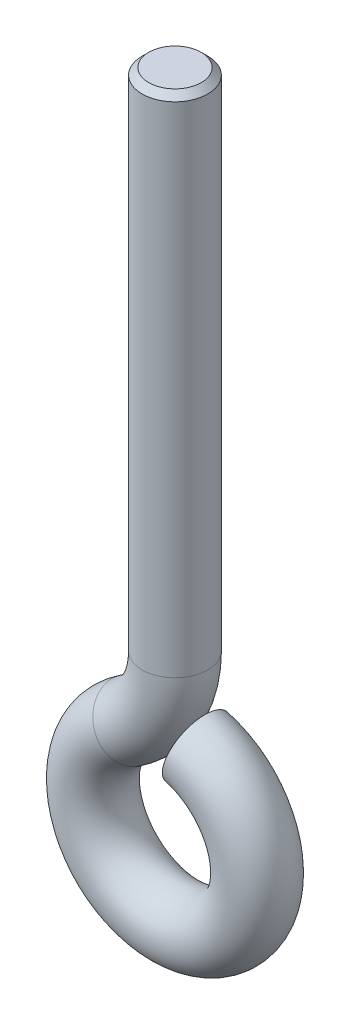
from build123d import *

# Parameters (mm, degrees)
ESQUISSE2_R     = 10
CHANFREIN1_SIZE = 2


with BuildPart() as part:
    # Balayage1: sweep along a path in Esquisse1
    with BuildLine(Plane.XY) as balayage1_path:
        Line((0, 200), (0, 46.097722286))
        ThreePointArc((0, 46.097722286), (-3.62852781, 31.795783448), (-13.636363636, 20.95351013))
        ThreePointArc((-13.636363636, 20.95351013), (3.922870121, -24.690303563), (6.470476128, 24.148145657))
    # Esquisse2 → Balayage1 (sweep)
    with BuildSketch(Plane(origin=(0, 200, 0), x_dir=(-1, 0, 0), z_dir=(0, 1, 0))):
        Circle(ESQUISSE2_R)
    sweep(path=balayage1_path.line)

    # Chanfrein1
    chanfrein1_edges = [part.edges().sort_by_distance(p)[0] for p in [
        (10, 200, 0),
    ]]
    chamfer(chanfrein1_edges, length=CHANFREIN1_SIZE)


solid = part.part
